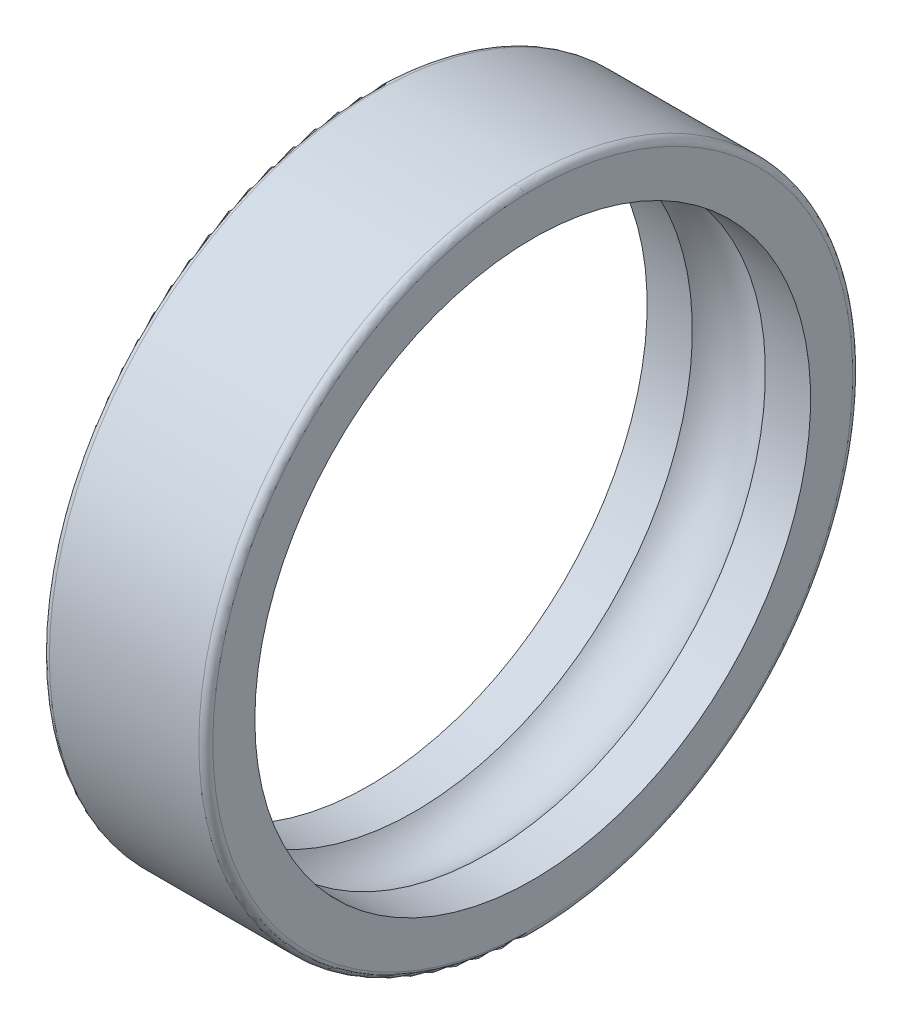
ISO-10303-21;
HEADER;
FILE_DESCRIPTION(('STEP AP214'),'2;1');
FILE_NAME('part.step','',(''),(''),'','','');
FILE_SCHEMA(('AUTOMOTIVE_DESIGN { 1 0 10303 214 1 1 1 1 }'));
ENDSEC;
DATA;
#1=APPLICATION_CONTEXT('core data for automotive mechanical design processes');
#2=APPLICATION_PROTOCOL_DEFINITION('international standard','automotive_design',2000,#1);
#3=PRODUCT_CONTEXT('',#1,'mechanical');
#4=PRODUCT('Part','Part','',(#3));
#5=PRODUCT_RELATED_PRODUCT_CATEGORY('part','',(#4));
#6=PRODUCT_DEFINITION_FORMATION('','',#4);
#7=PRODUCT_DEFINITION_CONTEXT('part definition',#1,'design');
#8=PRODUCT_DEFINITION('design','',#6,#7);
#9=PRODUCT_DEFINITION_SHAPE('','',#8);
#10=(LENGTH_UNIT() NAMED_UNIT(*) SI_UNIT(.MILLI.,.METRE.));
#11=(NAMED_UNIT(*) PLANE_ANGLE_UNIT() SI_UNIT($,.RADIAN.));
#12=(NAMED_UNIT(*) SI_UNIT($,.STERADIAN.) SOLID_ANGLE_UNIT());
#13=UNCERTAINTY_MEASURE_WITH_UNIT(LENGTH_MEASURE(1.E-05),#10,'distance_accuracy_value','');
#14=(GEOMETRIC_REPRESENTATION_CONTEXT(3) GLOBAL_UNCERTAINTY_ASSIGNED_CONTEXT((#13)) GLOBAL_UNIT_ASSIGNED_CONTEXT((#10,
#11,#12)) REPRESENTATION_CONTEXT('',''));
#15=CARTESIAN_POINT('',(0.,0.,0.));
#16=DIRECTION('',(0.,0.,1.));
#17=DIRECTION('',(1.,0.,0.));
#18=AXIS2_PLACEMENT_3D('',#15,#16,#17);
#19=CARTESIAN_POINT('',(0.150000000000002,0.,0.));
#20=DIRECTION('',(-1.,0.,0.));
#21=DIRECTION('',(0.,0.,1.));
#22=AXIS2_PLACEMENT_3D('',#19,#20,#21);
#23=TOROIDAL_SURFACE('',#22,6.85,0.150000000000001);
#24=CARTESIAN_POINT('',(0.,0.,0.));
#25=DIRECTION('',(-1.,0.,0.));
#26=DIRECTION('',(0.,0.,1.));
#27=AXIS2_PLACEMENT_3D('',#24,#25,#26);
#28=CIRCLE('',#27,6.85);
#29=CARTESIAN_POINT('',(0.,0.,6.85));
#30=VERTEX_POINT('',#29);
#31=EDGE_CURVE('E10',#30,#30,#28,.T.);
#32=ORIENTED_EDGE('',*,*,#31,.F.);
#33=EDGE_LOOP('',(#32));
#34=FACE_BOUND('',#33,.T.);
#35=CARTESIAN_POINT('',(0.150000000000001,0.,0.));
#36=DIRECTION('',(-1.,0.,0.));
#37=DIRECTION('',(0.,0.,1.));
#38=AXIS2_PLACEMENT_3D('',#35,#36,#37);
#39=CIRCLE('',#38,7.);
#40=CARTESIAN_POINT('',(0.150000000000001,0.,7.));
#41=VERTEX_POINT('',#40);
#42=EDGE_CURVE('E376',#41,#41,#39,.T.);
#43=ORIENTED_EDGE('',*,*,#42,.T.);
#44=EDGE_LOOP('',(#43));
#45=FACE_BOUND('',#44,.T.);
#46=ADVANCED_FACE('F348',(#34,#45),#23,.T.);
#47=CARTESIAN_POINT('',(0.,0.,-6.85));
#48=DIRECTION('',(1.,0.,0.));
#49=DIRECTION('',(0.,0.,-1.));
#50=AXIS2_PLACEMENT_3D('',#47,#48,#49);
#51=PLANE('',#50);
#52=CARTESIAN_POINT('',(0.,0.,0.));
#53=DIRECTION('',(-1.,0.,0.));
#54=DIRECTION('',(0.,0.,1.));
#55=AXIS2_PLACEMENT_3D('',#52,#53,#54);
#56=CIRCLE('',#55,5.95);
#57=CARTESIAN_POINT('',(0.,0.,5.95));
#58=VERTEX_POINT('',#57);
#59=EDGE_CURVE('E354',#58,#58,#56,.T.);
#60=ORIENTED_EDGE('',*,*,#59,.F.);
#61=EDGE_LOOP('',(#60));
#62=FACE_BOUND('',#61,.T.);
#63=ORIENTED_EDGE('',*,*,#31,.T.);
#64=EDGE_LOOP('',(#63));
#65=FACE_BOUND('',#64,.T.);
#66=ADVANCED_FACE('F413',(#62,#65),#51,.F.);
#67=CARTESIAN_POINT('',(0.,0.,0.));
#68=DIRECTION('',(-1.,0.,0.));
#69=DIRECTION('',(0.,0.,1.));
#70=AXIS2_PLACEMENT_3D('',#67,#68,#69);
#71=CYLINDRICAL_SURFACE('',#70,5.95);
#72=CARTESIAN_POINT('',(0.967376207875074,0.,0.));
#73=DIRECTION('',(-1.,0.,0.));
#74=DIRECTION('',(0.,0.,1.));
#75=AXIS2_PLACEMENT_3D('',#72,#73,#74);
#76=CIRCLE('',#75,5.95);
#77=CARTESIAN_POINT('',(0.967376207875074,0.,5.95));
#78=VERTEX_POINT('',#77);
#79=EDGE_CURVE('E358',#78,#78,#76,.T.);
#80=ORIENTED_EDGE('',*,*,#79,.F.);
#81=EDGE_LOOP('',(#80));
#82=FACE_BOUND('',#81,.T.);
#83=ORIENTED_EDGE('',*,*,#59,.T.);
#84=EDGE_LOOP('',(#83));
#85=FACE_BOUND('',#84,.T.);
#86=ADVANCED_FACE('F408',(#82,#85),#71,.F.);
#87=CARTESIAN_POINT('',(1.75,0.,0.));
#88=DIRECTION('',(-1.,0.,0.));
#89=DIRECTION('',(0.,0.,1.));
#90=AXIS2_PLACEMENT_3D('',#87,#88,#89);
#91=TOROIDAL_SURFACE('',#90,5.25,1.05);
#92=CARTESIAN_POINT('',(2.53262379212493,0.,0.));
#93=DIRECTION('',(-1.,0.,0.));
#94=DIRECTION('',(0.,0.,1.));
#95=AXIS2_PLACEMENT_3D('',#92,#93,#94);
#96=CIRCLE('',#95,5.95);
#97=CARTESIAN_POINT('',(2.53262379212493,0.,5.95));
#98=VERTEX_POINT('',#97);
#99=EDGE_CURVE('E362',#98,#98,#96,.T.);
#100=ORIENTED_EDGE('',*,*,#99,.F.);
#101=EDGE_LOOP('',(#100));
#102=FACE_BOUND('',#101,.T.);
#103=ORIENTED_EDGE('',*,*,#79,.T.);
#104=EDGE_LOOP('',(#103));
#105=FACE_BOUND('',#104,.T.);
#106=ADVANCED_FACE('F402',(#102,#105),#91,.F.);
#107=CARTESIAN_POINT('',(0.,0.,0.));
#108=DIRECTION('',(-1.,0.,0.));
#109=DIRECTION('',(0.,0.,1.));
#110=AXIS2_PLACEMENT_3D('',#107,#108,#109);
#111=CYLINDRICAL_SURFACE('',#110,5.95);
#112=CARTESIAN_POINT('',(3.5,0.,0.));
#113=DIRECTION('',(-1.,0.,0.));
#114=DIRECTION('',(0.,0.,1.));
#115=AXIS2_PLACEMENT_3D('',#112,#113,#114);
#116=CIRCLE('',#115,5.95);
#117=CARTESIAN_POINT('',(3.5,0.,5.95));
#118=VERTEX_POINT('',#117);
#119=EDGE_CURVE('E367',#118,#118,#116,.T.);
#120=ORIENTED_EDGE('',*,*,#119,.F.);
#121=EDGE_LOOP('',(#120));
#122=FACE_BOUND('',#121,.T.);
#123=ORIENTED_EDGE('',*,*,#99,.T.);
#124=EDGE_LOOP('',(#123));
#125=FACE_BOUND('',#124,.T.);
#126=ADVANCED_FACE('F396',(#122,#125),#111,.F.);
#127=CARTESIAN_POINT('',(3.5,0.,-6.85));
#128=DIRECTION('',(-1.,0.,0.));
#129=DIRECTION('',(0.,0.,1.));
#130=AXIS2_PLACEMENT_3D('',#127,#128,#129);
#131=PLANE('',#130);
#132=CARTESIAN_POINT('',(3.5,0.,0.));
#133=DIRECTION('',(-1.,0.,0.));
#134=DIRECTION('',(0.,0.,1.));
#135=AXIS2_PLACEMENT_3D('',#132,#133,#134);
#136=CIRCLE('',#135,6.85);
#137=CARTESIAN_POINT('',(3.5,0.,6.85));
#138=VERTEX_POINT('',#137);
#139=EDGE_CURVE('E370',#138,#138,#136,.T.);
#140=ORIENTED_EDGE('',*,*,#139,.F.);
#141=EDGE_LOOP('',(#140));
#142=FACE_BOUND('',#141,.T.);
#143=ORIENTED_EDGE('',*,*,#119,.T.);
#144=EDGE_LOOP('',(#143));
#145=FACE_BOUND('',#144,.T.);
#146=ADVANCED_FACE('F390',(#142,#145),#131,.F.);
#147=CARTESIAN_POINT('',(3.35,0.,0.));
#148=DIRECTION('',(-1.,0.,0.));
#149=DIRECTION('',(0.,0.,1.));
#150=AXIS2_PLACEMENT_3D('',#147,#148,#149);
#151=TOROIDAL_SURFACE('',#150,6.85,0.15);
#152=CARTESIAN_POINT('',(3.35,0.,0.));
#153=DIRECTION('',(-1.,0.,0.));
#154=DIRECTION('',(0.,0.,1.));
#155=AXIS2_PLACEMENT_3D('',#152,#153,#154);
#156=CIRCLE('',#155,7.);
#157=CARTESIAN_POINT('',(3.35,0.,7.));
#158=VERTEX_POINT('',#157);
#159=EDGE_CURVE('E373',#158,#158,#156,.T.);
#160=ORIENTED_EDGE('',*,*,#159,.F.);
#161=EDGE_LOOP('',(#160));
#162=FACE_BOUND('',#161,.T.);
#163=ORIENTED_EDGE('',*,*,#139,.T.);
#164=EDGE_LOOP('',(#163));
#165=FACE_BOUND('',#164,.T.);
#166=ADVANCED_FACE('F384',(#162,#165),#151,.T.);
#167=CARTESIAN_POINT('',(0.,0.,0.));
#168=DIRECTION('',(-1.,0.,0.));
#169=DIRECTION('',(0.,0.,1.));
#170=AXIS2_PLACEMENT_3D('',#167,#168,#169);
#171=CYLINDRICAL_SURFACE('',#170,7.);
#172=ORIENTED_EDGE('',*,*,#42,.F.);
#173=EDGE_LOOP('',(#172));
#174=FACE_BOUND('',#173,.T.);
#175=ORIENTED_EDGE('',*,*,#159,.T.);
#176=EDGE_LOOP('',(#175));
#177=FACE_BOUND('',#176,.T.);
#178=ADVANCED_FACE('F381',(#174,#177),#171,.T.);
#179=CLOSED_SHELL('',(#46,#66,#86,#106,#126,#146,#166,#178));
#180=MANIFOLD_SOLID_BREP('B2',#179);
#181=ADVANCED_BREP_SHAPE_REPRESENTATION('',(#18,#180),#14);
#182=SHAPE_DEFINITION_REPRESENTATION(#9,#181);
ENDSEC;
END-ISO-10303-21;
